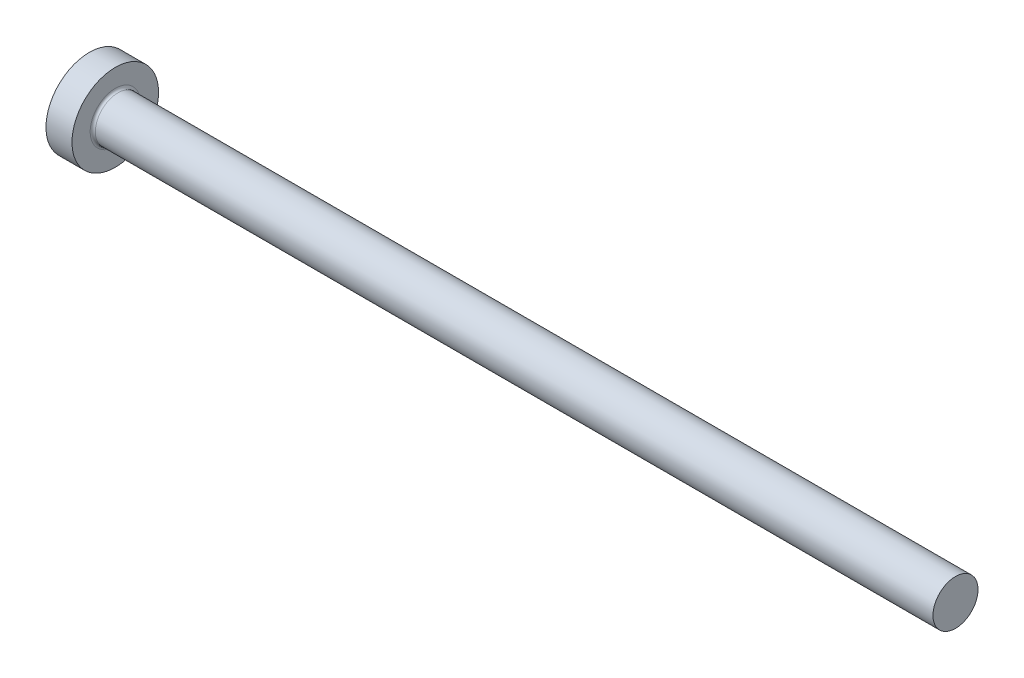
ISO-10303-21;
HEADER;
FILE_DESCRIPTION(('STEP AP214'),'2;1');
FILE_NAME('part.step','',(''),(''),'','','');
FILE_SCHEMA(('AUTOMOTIVE_DESIGN { 1 0 10303 214 1 1 1 1 }'));
ENDSEC;
DATA;
#1=APPLICATION_CONTEXT('core data for automotive mechanical design processes');
#2=APPLICATION_PROTOCOL_DEFINITION('international standard','automotive_design',2000,#1);
#3=PRODUCT_CONTEXT('',#1,'mechanical');
#4=PRODUCT('Part','Part','',(#3));
#5=PRODUCT_RELATED_PRODUCT_CATEGORY('part','',(#4));
#6=PRODUCT_DEFINITION_FORMATION('','',#4);
#7=PRODUCT_DEFINITION_CONTEXT('part definition',#1,'design');
#8=PRODUCT_DEFINITION('design','',#6,#7);
#9=PRODUCT_DEFINITION_SHAPE('','',#8);
#10=(LENGTH_UNIT() NAMED_UNIT(*) SI_UNIT(.MILLI.,.METRE.));
#11=(NAMED_UNIT(*) PLANE_ANGLE_UNIT() SI_UNIT($,.RADIAN.));
#12=(NAMED_UNIT(*) SI_UNIT($,.STERADIAN.) SOLID_ANGLE_UNIT());
#13=UNCERTAINTY_MEASURE_WITH_UNIT(LENGTH_MEASURE(1.E-05),#10,'distance_accuracy_value','');
#14=(GEOMETRIC_REPRESENTATION_CONTEXT(3) GLOBAL_UNCERTAINTY_ASSIGNED_CONTEXT((#13)) GLOBAL_UNIT_ASSIGNED_CONTEXT((#10,
#11,#12)) REPRESENTATION_CONTEXT('',''));
#15=CARTESIAN_POINT('',(0.,0.,0.));
#16=DIRECTION('',(0.,0.,1.));
#17=DIRECTION('',(1.,0.,0.));
#18=AXIS2_PLACEMENT_3D('',#15,#16,#17);
#19=CARTESIAN_POINT('',(0.,0.,0.));
#20=DIRECTION('',(-1.,0.,0.));
#21=DIRECTION('',(0.,-1.,0.));
#22=AXIS2_PLACEMENT_3D('',#19,#20,#21);
#23=PLANE('',#22);
#24=CARTESIAN_POINT('',(0.,0.,0.));
#25=DIRECTION('',(1.,0.,0.));
#26=DIRECTION('',(0.,1.,0.));
#27=AXIS2_PLACEMENT_3D('',#24,#25,#26);
#28=CIRCLE('',#27,5.);
#29=CARTESIAN_POINT('',(0.,5.,0.));
#30=VERTEX_POINT('',#29);
#31=EDGE_CURVE('E25',#30,#30,#28,.T.);
#32=ORIENTED_EDGE('',*,*,#31,.F.);
#33=EDGE_LOOP('',(#32));
#34=FACE_BOUND('',#33,.T.);
#35=ADVANCED_FACE('F14',(#34),#23,.T.);
#36=CARTESIAN_POINT('',(100.,0.,0.));
#37=DIRECTION('',(1.,0.,0.));
#38=DIRECTION('',(0.,1.,0.));
#39=AXIS2_PLACEMENT_3D('',#36,#37,#38);
#40=CYLINDRICAL_SURFACE('',#39,5.);
#41=ORIENTED_EDGE('',*,*,#31,.T.);
#42=EDGE_LOOP('',(#41));
#43=FACE_BOUND('',#42,.T.);
#44=CARTESIAN_POINT('',(3.,0.,0.));
#45=DIRECTION('',(1.,0.,0.));
#46=DIRECTION('',(0.,1.,0.));
#47=AXIS2_PLACEMENT_3D('',#44,#45,#46);
#48=CIRCLE('',#47,5.);
#49=CARTESIAN_POINT('',(3.,5.,0.));
#50=VERTEX_POINT('',#49);
#51=EDGE_CURVE('E29',#50,#50,#48,.T.);
#52=ORIENTED_EDGE('',*,*,#51,.F.);
#53=EDGE_LOOP('',(#52));
#54=FACE_BOUND('',#53,.T.);
#55=ADVANCED_FACE('F51',(#43,#54),#40,.T.);
#56=CARTESIAN_POINT('',(3.,5.,0.));
#57=DIRECTION('',(1.,0.,0.));
#58=DIRECTION('',(0.,1.,0.));
#59=AXIS2_PLACEMENT_3D('',#56,#57,#58);
#60=PLANE('',#59);
#61=CARTESIAN_POINT('',(3.,0.,0.));
#62=DIRECTION('',(1.,0.,0.));
#63=DIRECTION('',(0.,1.,0.));
#64=AXIS2_PLACEMENT_3D('',#61,#62,#63);
#65=CIRCLE('',#64,2.89999999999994);
#66=CARTESIAN_POINT('',(3.,2.89999999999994,0.));
#67=VERTEX_POINT('',#66);
#68=EDGE_CURVE('E9',#67,#67,#65,.F.);
#69=ORIENTED_EDGE('',*,*,#68,.T.);
#70=EDGE_LOOP('',(#69));
#71=FACE_BOUND('',#70,.T.);
#72=ORIENTED_EDGE('',*,*,#51,.T.);
#73=EDGE_LOOP('',(#72));
#74=FACE_BOUND('',#73,.T.);
#75=ADVANCED_FACE('F42',(#71,#74),#60,.T.);
#76=CARTESIAN_POINT('',(100.,0.,0.));
#77=DIRECTION('',(1.,0.,0.));
#78=DIRECTION('',(0.,1.,0.));
#79=AXIS2_PLACEMENT_3D('',#76,#77,#78);
#80=CYLINDRICAL_SURFACE('',#79,2.59999999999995);
#81=CARTESIAN_POINT('',(3.3,0.,0.));
#82=DIRECTION('',(1.,0.,0.));
#83=DIRECTION('',(0.,1.,0.));
#84=AXIS2_PLACEMENT_3D('',#81,#82,#83);
#85=CIRCLE('',#84,2.59999999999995);
#86=CARTESIAN_POINT('',(3.3,2.59999999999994,0.));
#87=VERTEX_POINT('',#86);
#88=EDGE_CURVE('E21',#87,#87,#85,.T.);
#89=ORIENTED_EDGE('',*,*,#88,.T.);
#90=EDGE_LOOP('',(#89));
#91=FACE_BOUND('',#90,.T.);
#92=CARTESIAN_POINT('',(100.,0.,0.));
#93=DIRECTION('',(1.,0.,0.));
#94=DIRECTION('',(0.,1.,0.));
#95=AXIS2_PLACEMENT_3D('',#92,#93,#94);
#96=CIRCLE('',#95,2.6);
#97=CARTESIAN_POINT('',(100.,2.59999999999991,0.));
#98=VERTEX_POINT('',#97);
#99=EDGE_CURVE('E34',#98,#98,#96,.T.);
#100=ORIENTED_EDGE('',*,*,#99,.F.);
#101=EDGE_LOOP('',(#100));
#102=FACE_BOUND('',#101,.T.);
#103=ADVANCED_FACE('F40',(#91,#102),#80,.T.);
#104=CARTESIAN_POINT('',(100.,2.59999999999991,0.));
#105=DIRECTION('',(1.,0.,0.));
#106=DIRECTION('',(0.,1.,0.));
#107=AXIS2_PLACEMENT_3D('',#104,#105,#106);
#108=PLANE('',#107);
#109=ORIENTED_EDGE('',*,*,#99,.T.);
#110=EDGE_LOOP('',(#109));
#111=FACE_BOUND('',#110,.T.);
#112=ADVANCED_FACE('F38',(#111),#108,.T.);
#113=CARTESIAN_POINT('',(3.3,0.,0.));
#114=DIRECTION('',(1.,0.,0.));
#115=DIRECTION('',(0.,1.,0.));
#116=AXIS2_PLACEMENT_3D('',#113,#114,#115);
#117=TOROIDAL_SURFACE('',#116,2.89999999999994,0.3);
#118=ORIENTED_EDGE('',*,*,#68,.F.);
#119=EDGE_LOOP('',(#118));
#120=FACE_BOUND('',#119,.T.);
#121=ORIENTED_EDGE('',*,*,#88,.F.);
#122=EDGE_LOOP('',(#121));
#123=FACE_BOUND('',#122,.T.);
#124=ADVANCED_FACE('F16',(#120,#123),#117,.F.);
#125=CLOSED_SHELL('',(#35,#55,#75,#103,#112,#124));
#126=MANIFOLD_SOLID_BREP('B1',#125);
#127=ADVANCED_BREP_SHAPE_REPRESENTATION('',(#18,#126),#14);
#128=SHAPE_DEFINITION_REPRESENTATION(#9,#127);
ENDSEC;
END-ISO-10303-21;
